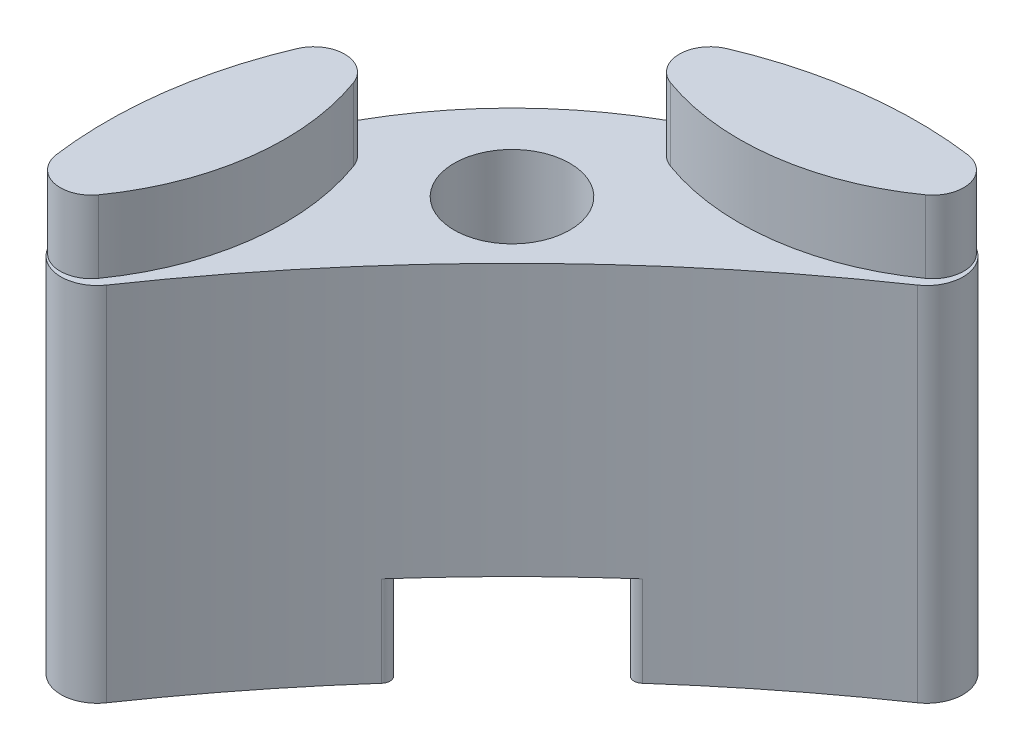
from build123d import *

# Parameters (mm, degrees)
SKETCH_1_R          = 1.6
EXTRUDE_1_DEPTH     = 3
EXTRUDE_START       = 20
SKETCH_2_R          = 1.6
EXTRUDE_2_DEPTH     = 10
SKETCH_3_R          = 3.05
CUT_EXTRUDE_4_DEPTH = 2.5
FILLET_1_R          = 0.25
EXTRUDE_3_DEPTH     = 2
SKETCH_5_R          = 50
CUT_EXTRUDE_5_DEPTH = 4


with BuildPart() as part:
    # Sketch 1 → Extrude 1 (new body)
    with BuildSketch(Plane(origin=(0, 0, 0), x_dir=(1, 0, 0), z_dir=(0, 1, 0))):
        with BuildLine():
            ThreePointArc((-34.779322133, 30.870677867), (-34.121320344, 34.121320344), (-30.870677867, 34.779322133))
            ThreePointArc((-30.870677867, 34.779322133), (-27.487559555, 34.304490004), (-24.282609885, 35.487390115))
            ThreePointArc((-24.282609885, 35.487390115), (0, 43), (24.282609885, 35.487390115))
            ThreePointArc((24.282609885, 35.487390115), (27.487559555, 34.304490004), (30.870677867, 34.779322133))
            ThreePointArc((30.870677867, 34.779322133), (34.121320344, 34.121320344), (34.779322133, 30.870677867))
            ThreePointArc((34.779322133, 30.870677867), (34.304490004, 27.487559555), (35.487390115, 24.282609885))
            ThreePointArc((35.487390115, 24.282609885), (43, 0), (35.487390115, -24.282609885))
            ThreePointArc((35.487390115, -24.282609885), (34.304490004, -27.487559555), (34.779322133, -30.870677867))
            ThreePointArc((34.779322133, -30.870677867), (34.121320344, -34.121320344), (30.870677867, -34.779322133))
            ThreePointArc((30.870677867, -34.779322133), (27.487559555, -34.304490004), (24.282609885, -35.487390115))
            ThreePointArc((24.282609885, -35.487390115), (0, -43), (-24.282609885, -35.487390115))
            ThreePointArc((-24.282609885, -35.487390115), (-27.487559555, -34.304490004), (-30.870677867, -34.779322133))
            ThreePointArc((-30.870677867, -34.779322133), (-34.121320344, -34.121320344), (-34.779322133, -30.870677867))
            ThreePointArc((-34.779322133, -30.870677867), (-34.304490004, -27.487559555), (-35.487390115, -24.282609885))
            ThreePointArc((-35.487390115, -24.282609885), (-43, 0), (-35.487390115, 24.282609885))
            ThreePointArc((-35.487390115, 24.282609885), (-34.304490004, 27.487559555), (-34.779322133, 30.870677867))
        make_face()
        with Locations(Location((-32, 32, 0), (0, 0, 270))):
            Circle(SKETCH_1_R, mode=Mode.SUBTRACT)
        with Locations(Location((32, 32, 0), (0, 0, 270))):
            Circle(SKETCH_1_R, mode=Mode.SUBTRACT)
        with Locations(Location((32, -32, 0), (0, 0, 270))):
            Circle(SKETCH_1_R, mode=Mode.SUBTRACT)
        with Locations(Location((-32, -32, 0), (0, 0, 270))):
            Circle(SKETCH_1_R, mode=Mode.SUBTRACT)
    extrude(amount=EXTRUDE_1_DEPTH)

    # Sketch 5 → Cut-Extrude 5 (cut)
    with BuildSketch(Plane(origin=(0, 3, 0), x_dir=(1, 0, 0), z_dir=(0, 1, 0))):
        Circle(SKETCH_5_R)
    extrude(amount=-CUT_EXTRUDE_5_DEPTH, mode=Mode.SUBTRACT)


with BuildPart() as body_2:
    # Sketch 2 → Extrude 2 (new body)
    with BuildSketch(Plane.XZ.offset(EXTRUDE_START)):
        with BuildLine():
            ThreePointArc((-35.487390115, -24.282609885), (-30.405591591, -30.405591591), (-24.282609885, -35.487390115))
            ThreePointArc((-24.282609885, -35.487390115), (-23.874479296, -36.544146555), (-24.714802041, -37.303858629))
            ThreePointArc((-24.714802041, -37.303858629), (-34.121320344, -34.121320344), (-37.303858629, -24.714802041))
            ThreePointArc((-37.303858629, -24.714802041), (-36.544146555, -23.874479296), (-35.487390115, -24.282609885))
        make_face()
        with Locations(Location((-32, -32, 0), (0, 0, 270))):
            Circle(SKETCH_2_R, mode=Mode.SUBTRACT)
    extrude(amount=-EXTRUDE_2_DEPTH)

    # Sketch 3 → Cut-Extrude 4 (cut)
    with BuildSketch(Plane.XZ.offset(20)):
        with Locations((-32, -32)):
            Circle(SKETCH_3_R)
    extrude(amount=-CUT_EXTRUDE_4_DEPTH, mode=Mode.SUBTRACT)

    # Fillet 1
    fillet_1_edges = [body_2.edges().sort_by_distance(p)[0] for p in [
        (-28.957384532, -18.75, -31.787888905),
        (-31.787888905, -18.75, -28.957384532),
        (-34.562588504, -18.75, -33.653977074),
        (-33.653977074, -18.75, -34.562588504),
    ]]
    fillet(fillet_1_edges, radius=FILLET_1_R)

    # Sketch 4 → Extrude 3 (add)
    with BuildSketch(Plane(origin=(0, -10, 0), x_dir=(1, 0, 0), z_dir=(0, 1, 0))):
        with BuildLine():
            ThreePointArc((-34.918404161, 30.53575518), (-34.575228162, 27.331499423), (-35.75671145, 24.333312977))
            ThreePointArc((-35.75671145, 24.333312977), (-36.660239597, 23.997020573), (-37.303858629, 24.714802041))
            ThreePointArc((-37.303858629, 24.714802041), (-37.301719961, 27.700005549), (-36.511312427, 30.578668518))
            ThreePointArc((-36.511312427, 30.578668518), (-35.700239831, 31.099837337), (-34.918404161, 30.53575518))
        make_face()
        with BuildLine():
            ThreePointArc((-30.578668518, 36.511312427), (-31.099837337, 35.700239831), (-30.53575518, 34.918404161))
            ThreePointArc((-30.53575518, 34.918404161), (-27.331499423, 34.575228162), (-24.333312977, 35.75671145))
            ThreePointArc((-24.333312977, 35.75671145), (-23.997020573, 36.660239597), (-24.714802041, 37.303858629))
            ThreePointArc((-24.714802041, 37.303858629), (-27.700005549, 37.301719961), (-30.578668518, 36.511312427))
        make_face()
    extrude(amount=EXTRUDE_3_DEPTH)


solid = body_2.part
